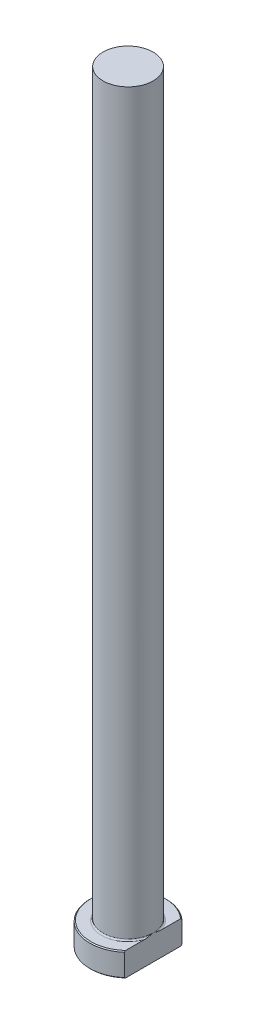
from build123d import *
from build123d.topology import SkipClean

# Parameters (mm, degrees)
CHAMFER1_SIZE = 0.2
FILLET1_R     = 0.3
KEY_DEPTH     = 161.399501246


with BuildPart() as part:
    # Sketch1 → Revolve1 (revolve)
    with BuildSketch(Plane.XY, mode=Mode.PRIVATE) as revolve1_sk:
        Polygon((0, 0), (-8, 0), (-8, 5), (-5.25, 5), (-5.25, 160), (0, 160), align=None)
    revolve(revolve1_sk.sketch.rotate(Axis((0, 259.958771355, 0), (0, -1, 0)), 270), axis=Axis((0, 259.958771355, 0), (0, -1, 0)))

    # Chamfer1
    chamfer1_edges = [part.edges().sort_by_distance(p)[0] for p in [
        (0, 5, -8),
        (0, 0, -8),
    ]]
    chamfer(chamfer1_edges, length=CHAMFER1_SIZE)

    # Fillet1
    fillet1_edges = [part.edges().sort_by_distance(p)[0] for p in [
        (0, 5, -5.25),
    ]]
    fillet(fillet1_edges, radius=FILLET1_R)

    # Sketch2 → KEY (cut, through all)
    with SkipClean():  # the faces are left unmerged after this step: merging them gives an invalid solid
        with BuildSketch(Plane(origin=(0, 0, 0), x_dir=(1, 0, 0), z_dir=(0, 1, 0))):
            with BuildLine():
                Line((5.25, 6.036348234), (5.25, -6.036348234))
                ThreePointArc((5.25, -6.036348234), (8, 0), (5.25, 6.036348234))
            make_face()
        extrude(amount=KEY_DEPTH, mode=Mode.SUBTRACT)


solid = part.part
